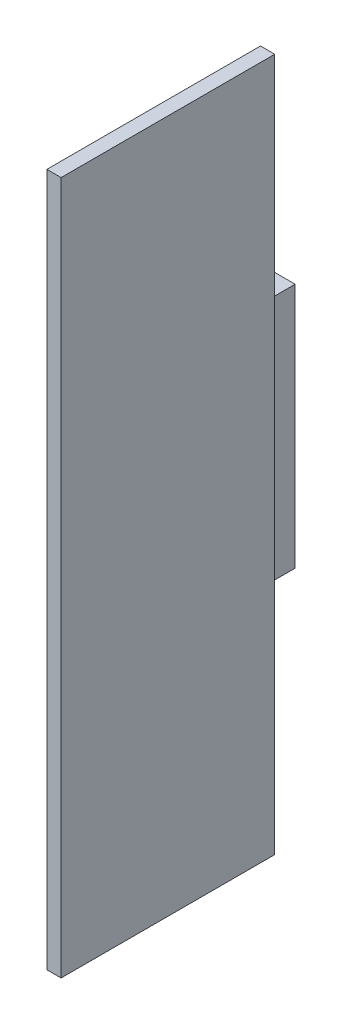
ISO-10303-21;
HEADER;
FILE_DESCRIPTION(('STEP AP214'),'2;1');
FILE_NAME('part.step','',(''),(''),'','','');
FILE_SCHEMA(('AUTOMOTIVE_DESIGN { 1 0 10303 214 1 1 1 1 }'));
ENDSEC;
DATA;
#1=APPLICATION_CONTEXT('core data for automotive mechanical design processes');
#2=APPLICATION_PROTOCOL_DEFINITION('international standard','automotive_design',2000,#1);
#3=PRODUCT_CONTEXT('',#1,'mechanical');
#4=PRODUCT('Part','Part','',(#3));
#5=PRODUCT_RELATED_PRODUCT_CATEGORY('part','',(#4));
#6=PRODUCT_DEFINITION_FORMATION('','',#4);
#7=PRODUCT_DEFINITION_CONTEXT('part definition',#1,'design');
#8=PRODUCT_DEFINITION('design','',#6,#7);
#9=PRODUCT_DEFINITION_SHAPE('','',#8);
#10=(LENGTH_UNIT() NAMED_UNIT(*) SI_UNIT(.MILLI.,.METRE.));
#11=(NAMED_UNIT(*) PLANE_ANGLE_UNIT() SI_UNIT($,.RADIAN.));
#12=(NAMED_UNIT(*) SI_UNIT($,.STERADIAN.) SOLID_ANGLE_UNIT());
#13=UNCERTAINTY_MEASURE_WITH_UNIT(LENGTH_MEASURE(1.E-05),#10,'distance_accuracy_value','');
#14=(GEOMETRIC_REPRESENTATION_CONTEXT(3) GLOBAL_UNCERTAINTY_ASSIGNED_CONTEXT((#13)) GLOBAL_UNIT_ASSIGNED_CONTEXT((#10,
#11,#12)) REPRESENTATION_CONTEXT('',''));
#15=CARTESIAN_POINT('',(0.,0.,0.));
#16=DIRECTION('',(0.,0.,1.));
#17=DIRECTION('',(1.,0.,0.));
#18=AXIS2_PLACEMENT_3D('',#15,#16,#17);
#19=CARTESIAN_POINT('',(3.,73.,45.));
#20=DIRECTION('',(0.,0.,-1.));
#21=DIRECTION('',(0.,1.,0.));
#22=AXIS2_PLACEMENT_3D('',#19,#20,#21);
#23=PLANE('',#22);
#24=DIRECTION('',(0.,-1.,0.));
#25=VECTOR('',#24,1.);
#26=CARTESIAN_POINT('',(0.,73.,45.));
#27=LINE('',#26,#25);
#28=CARTESIAN_POINT('',(0.,73.,45.));
#29=VERTEX_POINT('',#28);
#30=CARTESIAN_POINT('',(0.,-73.,45.));
#31=VERTEX_POINT('',#30);
#32=EDGE_CURVE('E155',#29,#31,#27,.T.);
#33=ORIENTED_EDGE('',*,*,#32,.T.);
#34=DIRECTION('',(-1.,0.,0.));
#35=VECTOR('',#34,1.);
#36=CARTESIAN_POINT('',(3.,-73.,45.));
#37=LINE('',#36,#35);
#38=CARTESIAN_POINT('',(3.,-73.,45.));
#39=VERTEX_POINT('',#38);
#40=EDGE_CURVE('E9',#39,#31,#37,.T.);
#41=ORIENTED_EDGE('',*,*,#40,.F.);
#42=DIRECTION('',(0.,-1.,0.));
#43=VECTOR('',#42,1.);
#44=CARTESIAN_POINT('',(3.,73.,45.));
#45=LINE('',#44,#43);
#46=CARTESIAN_POINT('',(3.,73.,45.));
#47=VERTEX_POINT('',#46);
#48=EDGE_CURVE('E196',#47,#39,#45,.T.);
#49=ORIENTED_EDGE('',*,*,#48,.F.);
#50=DIRECTION('',(-1.,0.,0.));
#51=VECTOR('',#50,1.);
#52=CARTESIAN_POINT('',(3.,73.,45.));
#53=LINE('',#52,#51);
#54=EDGE_CURVE('E193',#47,#29,#53,.T.);
#55=ORIENTED_EDGE('',*,*,#54,.T.);
#56=EDGE_LOOP('',(#33,#41,#49,#55));
#57=FACE_BOUND('',#56,.T.);
#58=ADVANCED_FACE('F14',(#57),#23,.F.);
#59=CARTESIAN_POINT('',(3.,-73.,45.));
#60=DIRECTION('',(0.,1.,0.));
#61=DIRECTION('',(-1.,0.,0.));
#62=AXIS2_PLACEMENT_3D('',#59,#60,#61);
#63=PLANE('',#62);
#64=DIRECTION('',(0.,0.,-1.));
#65=VECTOR('',#64,1.);
#66=CARTESIAN_POINT('',(0.,-73.,45.));
#67=LINE('',#66,#65);
#68=CARTESIAN_POINT('',(0.,-73.,0.));
#69=VERTEX_POINT('',#68);
#70=EDGE_CURVE('E165',#31,#69,#67,.T.);
#71=ORIENTED_EDGE('',*,*,#70,.T.);
#72=DIRECTION('',(-1.,0.,0.));
#73=VECTOR('',#72,1.);
#74=CARTESIAN_POINT('',(3.,-73.,0.));
#75=LINE('',#74,#73);
#76=CARTESIAN_POINT('',(3.,-73.,0.));
#77=VERTEX_POINT('',#76);
#78=EDGE_CURVE('E23',#77,#69,#75,.T.);
#79=ORIENTED_EDGE('',*,*,#78,.F.);
#80=DIRECTION('',(0.,0.,-1.));
#81=VECTOR('',#80,1.);
#82=CARTESIAN_POINT('',(3.,-73.,45.));
#83=LINE('',#82,#81);
#84=EDGE_CURVE('E197',#39,#77,#83,.T.);
#85=ORIENTED_EDGE('',*,*,#84,.F.);
#86=ORIENTED_EDGE('',*,*,#40,.T.);
#87=EDGE_LOOP('',(#71,#79,#85,#86));
#88=FACE_BOUND('',#87,.T.);
#89=ADVANCED_FACE('F208',(#88),#63,.F.);
#90=CARTESIAN_POINT('',(3.,-73.,0.));
#91=DIRECTION('',(0.,0.,1.));
#92=DIRECTION('',(1.,0.,0.));
#93=AXIS2_PLACEMENT_3D('',#90,#91,#92);
#94=PLANE('',#93);
#95=DIRECTION('',(0.,1.,0.));
#96=VECTOR('',#95,1.);
#97=CARTESIAN_POINT('',(0.,-73.,0.));
#98=LINE('',#97,#96);
#99=CARTESIAN_POINT('',(0.,-35.,0.));
#100=VERTEX_POINT('',#99);
#101=EDGE_CURVE('E178',#69,#100,#98,.T.);
#102=ORIENTED_EDGE('',*,*,#101,.T.);
#103=DIRECTION('',(1.,0.,0.));
#104=VECTOR('',#103,1.);
#105=CARTESIAN_POINT('',(-6.,-35.,0.));
#106=LINE('',#105,#104);
#107=CARTESIAN_POINT('',(-6.,-35.,0.));
#108=VERTEX_POINT('',#107);
#109=EDGE_CURVE('E112',#108,#100,#106,.T.);
#110=ORIENTED_EDGE('',*,*,#109,.F.);
#111=DIRECTION('',(0.,1.,0.));
#112=VECTOR('',#111,1.);
#113=CARTESIAN_POINT('',(-6.,-35.,0.));
#114=LINE('',#113,#112);
#115=CARTESIAN_POINT('',(-6.,-25.9,0.));
#116=VERTEX_POINT('',#115);
#117=EDGE_CURVE('E136',#108,#116,#114,.T.);
#118=ORIENTED_EDGE('',*,*,#117,.T.);
#119=DIRECTION('',(1.,0.,0.));
#120=VECTOR('',#119,1.);
#121=CARTESIAN_POINT('',(-6.,-25.9,0.));
#122=LINE('',#121,#120);
#123=CARTESIAN_POINT('',(0.,-25.9,0.));
#124=VERTEX_POINT('',#123);
#125=EDGE_CURVE('E161',#116,#124,#122,.T.);
#126=ORIENTED_EDGE('',*,*,#125,.T.);
#127=CARTESIAN_POINT('',(0.,25.9,0.));
#128=VERTEX_POINT('',#127);
#129=EDGE_CURVE('E179',#124,#128,#98,.T.);
#130=ORIENTED_EDGE('',*,*,#129,.T.);
#131=DIRECTION('',(1.,0.,0.));
#132=VECTOR('',#131,1.);
#133=CARTESIAN_POINT('',(-6.,25.9,0.));
#134=LINE('',#133,#132);
#135=CARTESIAN_POINT('',(-6.,25.9,0.));
#136=VERTEX_POINT('',#135);
#137=EDGE_CURVE('E159',#136,#128,#134,.T.);
#138=ORIENTED_EDGE('',*,*,#137,.F.);
#139=DIRECTION('',(0.,1.,0.));
#140=VECTOR('',#139,1.);
#141=CARTESIAN_POINT('',(-6.,25.9,0.));
#142=LINE('',#141,#140);
#143=CARTESIAN_POINT('',(-6.,34.9999999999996,0.));
#144=VERTEX_POINT('',#143);
#145=EDGE_CURVE('E148',#136,#144,#142,.T.);
#146=ORIENTED_EDGE('',*,*,#145,.T.);
#147=DIRECTION('',(1.,0.,0.));
#148=VECTOR('',#147,1.);
#149=CARTESIAN_POINT('',(-6.,34.9999999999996,0.));
#150=LINE('',#149,#148);
#151=CARTESIAN_POINT('',(0.,34.9999999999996,0.));
#152=VERTEX_POINT('',#151);
#153=EDGE_CURVE('E156',#144,#152,#150,.T.);
#154=ORIENTED_EDGE('',*,*,#153,.T.);
#155=CARTESIAN_POINT('',(0.,73.,0.));
#156=VERTEX_POINT('',#155);
#157=EDGE_CURVE('E167',#152,#156,#98,.T.);
#158=ORIENTED_EDGE('',*,*,#157,.T.);
#159=DIRECTION('',(-1.,0.,0.));
#160=VECTOR('',#159,1.);
#161=CARTESIAN_POINT('',(3.,73.,0.));
#162=LINE('',#161,#160);
#163=CARTESIAN_POINT('',(3.,73.,0.));
#164=VERTEX_POINT('',#163);
#165=EDGE_CURVE('E188',#164,#156,#162,.T.);
#166=ORIENTED_EDGE('',*,*,#165,.F.);
#167=DIRECTION('',(0.,1.,0.));
#168=VECTOR('',#167,1.);
#169=CARTESIAN_POINT('',(3.,-73.,0.));
#170=LINE('',#169,#168);
#171=EDGE_CURVE('E200',#77,#164,#170,.T.);
#172=ORIENTED_EDGE('',*,*,#171,.F.);
#173=ORIENTED_EDGE('',*,*,#78,.T.);
#174=EDGE_LOOP('',(#102,#110,#118,#126,#130,#138,#146,#154,#158,#166,#172,#173));
#175=FACE_BOUND('',#174,.T.);
#176=ADVANCED_FACE('F186',(#175),#94,.F.);
#177=CARTESIAN_POINT('',(3.,73.,0.));
#178=DIRECTION('',(0.,-1.,0.));
#179=DIRECTION('',(1.,0.,0.));
#180=AXIS2_PLACEMENT_3D('',#177,#178,#179);
#181=PLANE('',#180);
#182=DIRECTION('',(0.,0.,1.));
#183=VECTOR('',#182,1.);
#184=CARTESIAN_POINT('',(0.,73.,0.));
#185=LINE('',#184,#183);
#186=EDGE_CURVE('E170',#156,#29,#185,.T.);
#187=ORIENTED_EDGE('',*,*,#186,.T.);
#188=ORIENTED_EDGE('',*,*,#54,.F.);
#189=DIRECTION('',(0.,0.,1.));
#190=VECTOR('',#189,1.);
#191=CARTESIAN_POINT('',(3.,73.,0.));
#192=LINE('',#191,#190);
#193=EDGE_CURVE('E39',#164,#47,#192,.T.);
#194=ORIENTED_EDGE('',*,*,#193,.F.);
#195=ORIENTED_EDGE('',*,*,#165,.T.);
#196=EDGE_LOOP('',(#187,#188,#194,#195));
#197=FACE_BOUND('',#196,.T.);
#198=ADVANCED_FACE('F191',(#197),#181,.F.);
#199=CARTESIAN_POINT('',(3.,-73.,45.));
#200=DIRECTION('',(1.,0.,0.));
#201=DIRECTION('',(0.,1.,0.));
#202=AXIS2_PLACEMENT_3D('',#199,#200,#201);
#203=PLANE('',#202);
#204=ORIENTED_EDGE('',*,*,#48,.T.);
#205=ORIENTED_EDGE('',*,*,#84,.T.);
#206=ORIENTED_EDGE('',*,*,#171,.T.);
#207=ORIENTED_EDGE('',*,*,#193,.T.);
#208=EDGE_LOOP('',(#204,#205,#206,#207));
#209=FACE_BOUND('',#208,.T.);
#210=ADVANCED_FACE('F224',(#209),#203,.T.);
#211=CARTESIAN_POINT('',(0.,-73.,45.));
#212=DIRECTION('',(1.,0.,0.));
#213=DIRECTION('',(0.,1.,0.));
#214=AXIS2_PLACEMENT_3D('',#211,#212,#213);
#215=PLANE('',#214);
#216=DIRECTION('',(0.,-1.,0.));
#217=VECTOR('',#216,1.);
#218=CARTESIAN_POINT('',(0.,-35.,7.69999999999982));
#219=LINE('',#218,#217);
#220=CARTESIAN_POINT('',(0.,35.,7.69999999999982));
#221=VERTEX_POINT('',#220);
#222=CARTESIAN_POINT('',(0.,-35.,7.69999999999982));
#223=VERTEX_POINT('',#222);
#224=EDGE_CURVE('E31',#221,#223,#219,.T.);
#225=ORIENTED_EDGE('',*,*,#224,.T.);
#226=DIRECTION('',(0.,0.,-1.));
#227=VECTOR('',#226,1.);
#228=CARTESIAN_POINT('',(0.,-35.,0.));
#229=LINE('',#228,#227);
#230=EDGE_CURVE('E17',#223,#100,#229,.T.);
#231=ORIENTED_EDGE('',*,*,#230,.T.);
#232=ORIENTED_EDGE('',*,*,#101,.F.);
#233=ORIENTED_EDGE('',*,*,#70,.F.);
#234=ORIENTED_EDGE('',*,*,#32,.F.);
#235=ORIENTED_EDGE('',*,*,#186,.F.);
#236=ORIENTED_EDGE('',*,*,#157,.F.);
#237=DIRECTION('',(0.,0.,1.));
#238=VECTOR('',#237,1.);
#239=CARTESIAN_POINT('',(0.,35.,7.69999999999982));
#240=LINE('',#239,#238);
#241=EDGE_CURVE('E125',#152,#221,#240,.T.);
#242=ORIENTED_EDGE('',*,*,#241,.T.);
#243=EDGE_LOOP('',(#225,#231,#232,#233,#234,#235,#236,#242));
#244=FACE_BOUND('',#243,.T.);
#245=ADVANCED_FACE('F122',(#244),#215,.F.);
#246=CARTESIAN_POINT('',(0.,25.9,7.69999999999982));
#247=DIRECTION('',(1.,0.,0.));
#248=DIRECTION('',(0.,1.,0.));
#249=AXIS2_PLACEMENT_3D('',#246,#247,#248);
#250=PLANE('',#249);
#251=ORIENTED_EDGE('',*,*,#129,.F.);
#252=DIRECTION('',(0.,0.,-1.));
#253=VECTOR('',#252,1.);
#254=CARTESIAN_POINT('',(0.,-25.9,0.));
#255=LINE('',#254,#253);
#256=CARTESIAN_POINT('',(0.,-25.9,-7.30000000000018));
#257=VERTEX_POINT('',#256);
#258=EDGE_CURVE('E120',#124,#257,#255,.T.);
#259=ORIENTED_EDGE('',*,*,#258,.T.);
#260=DIRECTION('',(0.,1.,0.));
#261=VECTOR('',#260,1.);
#262=CARTESIAN_POINT('',(0.,-25.9,-7.30000000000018));
#263=LINE('',#262,#261);
#264=CARTESIAN_POINT('',(0.,25.9,-7.30000000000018));
#265=VERTEX_POINT('',#264);
#266=EDGE_CURVE('E129',#257,#265,#263,.T.);
#267=ORIENTED_EDGE('',*,*,#266,.T.);
#268=DIRECTION('',(0.,0.,1.));
#269=VECTOR('',#268,1.);
#270=CARTESIAN_POINT('',(0.,25.9,-7.30000000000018));
#271=LINE('',#270,#269);
#272=EDGE_CURVE('E132',#265,#128,#271,.T.);
#273=ORIENTED_EDGE('',*,*,#272,.T.);
#274=EDGE_LOOP('',(#251,#259,#267,#273));
#275=FACE_BOUND('',#274,.T.);
#276=ADVANCED_FACE('F229',(#275),#250,.T.);
#277=CARTESIAN_POINT('',(-6.,-35.,7.69999999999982));
#278=DIRECTION('',(0.,0.,1.));
#279=DIRECTION('',(1.,0.,0.));
#280=AXIS2_PLACEMENT_3D('',#277,#278,#279);
#281=PLANE('',#280);
#282=ORIENTED_EDGE('',*,*,#224,.F.);
#283=DIRECTION('',(1.,0.,0.));
#284=VECTOR('',#283,1.);
#285=CARTESIAN_POINT('',(-6.,35.,7.69999999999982));
#286=LINE('',#285,#284);
#287=CARTESIAN_POINT('',(-6.,35.,7.69999999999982));
#288=VERTEX_POINT('',#287);
#289=EDGE_CURVE('E153',#288,#221,#286,.T.);
#290=ORIENTED_EDGE('',*,*,#289,.F.);
#291=DIRECTION('',(0.,-1.,0.));
#292=VECTOR('',#291,1.);
#293=CARTESIAN_POINT('',(-6.,-35.,7.69999999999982));
#294=LINE('',#293,#292);
#295=CARTESIAN_POINT('',(-6.,-35.,7.69999999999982));
#296=VERTEX_POINT('',#295);
#297=EDGE_CURVE('E108',#288,#296,#294,.T.);
#298=ORIENTED_EDGE('',*,*,#297,.T.);
#299=DIRECTION('',(1.,0.,0.));
#300=VECTOR('',#299,1.);
#301=CARTESIAN_POINT('',(-6.,-35.,7.69999999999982));
#302=LINE('',#301,#300);
#303=EDGE_CURVE('E104',#296,#223,#302,.T.);
#304=ORIENTED_EDGE('',*,*,#303,.T.);
#305=EDGE_LOOP('',(#282,#290,#298,#304));
#306=FACE_BOUND('',#305,.T.);
#307=ADVANCED_FACE('F106',(#306),#281,.T.);
#308=CARTESIAN_POINT('',(-6.,35.,7.69999999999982));
#309=DIRECTION('',(0.,1.,0.));
#310=DIRECTION('',(0.,0.,1.));
#311=AXIS2_PLACEMENT_3D('',#308,#309,#310);
#312=PLANE('',#311);
#313=ORIENTED_EDGE('',*,*,#241,.F.);
#314=ORIENTED_EDGE('',*,*,#153,.F.);
#315=DIRECTION('',(0.,0.,1.));
#316=VECTOR('',#315,1.);
#317=CARTESIAN_POINT('',(-6.,35.,7.69999999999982));
#318=LINE('',#317,#316);
#319=EDGE_CURVE('E113',#144,#288,#318,.T.);
#320=ORIENTED_EDGE('',*,*,#319,.T.);
#321=ORIENTED_EDGE('',*,*,#289,.T.);
#322=EDGE_LOOP('',(#313,#314,#320,#321));
#323=FACE_BOUND('',#322,.T.);
#324=ADVANCED_FACE('F232',(#323),#312,.T.);
#325=CARTESIAN_POINT('',(-6.,25.9,-7.30000000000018));
#326=DIRECTION('',(0.,1.,0.));
#327=DIRECTION('',(-1.,0.,0.));
#328=AXIS2_PLACEMENT_3D('',#325,#326,#327);
#329=PLANE('',#328);
#330=ORIENTED_EDGE('',*,*,#272,.F.);
#331=DIRECTION('',(1.,0.,0.));
#332=VECTOR('',#331,1.);
#333=CARTESIAN_POINT('',(-6.,25.9,-7.30000000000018));
#334=LINE('',#333,#332);
#335=CARTESIAN_POINT('',(-6.,25.9,-7.30000000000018));
#336=VERTEX_POINT('',#335);
#337=EDGE_CURVE('E157',#336,#265,#334,.T.);
#338=ORIENTED_EDGE('',*,*,#337,.F.);
#339=DIRECTION('',(0.,0.,1.));
#340=VECTOR('',#339,1.);
#341=CARTESIAN_POINT('',(-6.,25.9,-7.30000000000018));
#342=LINE('',#341,#340);
#343=EDGE_CURVE('E145',#336,#136,#342,.T.);
#344=ORIENTED_EDGE('',*,*,#343,.T.);
#345=ORIENTED_EDGE('',*,*,#137,.T.);
#346=EDGE_LOOP('',(#330,#338,#344,#345));
#347=FACE_BOUND('',#346,.T.);
#348=ADVANCED_FACE('F243',(#347),#329,.T.);
#349=CARTESIAN_POINT('',(-6.,-25.9,-7.30000000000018));
#350=DIRECTION('',(0.,0.,-1.));
#351=DIRECTION('',(-1.,0.,0.));
#352=AXIS2_PLACEMENT_3D('',#349,#350,#351);
#353=PLANE('',#352);
#354=ORIENTED_EDGE('',*,*,#266,.F.);
#355=DIRECTION('',(1.,0.,0.));
#356=VECTOR('',#355,1.);
#357=CARTESIAN_POINT('',(-6.,-25.9,-7.30000000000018));
#358=LINE('',#357,#356);
#359=CARTESIAN_POINT('',(-6.,-25.9,-7.30000000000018));
#360=VERTEX_POINT('',#359);
#361=EDGE_CURVE('E160',#360,#257,#358,.T.);
#362=ORIENTED_EDGE('',*,*,#361,.F.);
#363=DIRECTION('',(0.,1.,0.));
#364=VECTOR('',#363,1.);
#365=CARTESIAN_POINT('',(-6.,-25.9,-7.30000000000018));
#366=LINE('',#365,#364);
#367=EDGE_CURVE('E142',#360,#336,#366,.T.);
#368=ORIENTED_EDGE('',*,*,#367,.T.);
#369=ORIENTED_EDGE('',*,*,#337,.T.);
#370=EDGE_LOOP('',(#354,#362,#368,#369));
#371=FACE_BOUND('',#370,.T.);
#372=ADVANCED_FACE('F239',(#371),#353,.T.);
#373=CARTESIAN_POINT('',(-6.,-25.9,0.));
#374=DIRECTION('',(0.,-1.,0.));
#375=DIRECTION('',(1.,0.,0.));
#376=AXIS2_PLACEMENT_3D('',#373,#374,#375);
#377=PLANE('',#376);
#378=ORIENTED_EDGE('',*,*,#258,.F.);
#379=ORIENTED_EDGE('',*,*,#125,.F.);
#380=DIRECTION('',(0.,0.,-1.));
#381=VECTOR('',#380,1.);
#382=CARTESIAN_POINT('',(-6.,-25.9,0.));
#383=LINE('',#382,#381);
#384=EDGE_CURVE('E139',#116,#360,#383,.T.);
#385=ORIENTED_EDGE('',*,*,#384,.T.);
#386=ORIENTED_EDGE('',*,*,#361,.T.);
#387=EDGE_LOOP('',(#378,#379,#385,#386));
#388=FACE_BOUND('',#387,.T.);
#389=ADVANCED_FACE('F236',(#388),#377,.T.);
#390=CARTESIAN_POINT('',(-6.,-35.,0.));
#391=DIRECTION('',(0.,-1.,0.));
#392=DIRECTION('',(1.,0.,0.));
#393=AXIS2_PLACEMENT_3D('',#390,#391,#392);
#394=PLANE('',#393);
#395=ORIENTED_EDGE('',*,*,#230,.F.);
#396=ORIENTED_EDGE('',*,*,#303,.F.);
#397=DIRECTION('',(0.,0.,-1.));
#398=VECTOR('',#397,1.);
#399=CARTESIAN_POINT('',(-6.,-35.,0.));
#400=LINE('',#399,#398);
#401=EDGE_CURVE('E134',#296,#108,#400,.T.);
#402=ORIENTED_EDGE('',*,*,#401,.T.);
#403=ORIENTED_EDGE('',*,*,#109,.T.);
#404=EDGE_LOOP('',(#395,#396,#402,#403));
#405=FACE_BOUND('',#404,.T.);
#406=ADVANCED_FACE('F116',(#405),#394,.T.);
#407=CARTESIAN_POINT('',(-6.,25.9,7.69999999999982));
#408=DIRECTION('',(1.,0.,0.));
#409=DIRECTION('',(0.,1.,0.));
#410=AXIS2_PLACEMENT_3D('',#407,#408,#409);
#411=PLANE('',#410);
#412=ORIENTED_EDGE('',*,*,#297,.F.);
#413=ORIENTED_EDGE('',*,*,#319,.F.);
#414=ORIENTED_EDGE('',*,*,#145,.F.);
#415=ORIENTED_EDGE('',*,*,#343,.F.);
#416=ORIENTED_EDGE('',*,*,#367,.F.);
#417=ORIENTED_EDGE('',*,*,#384,.F.);
#418=ORIENTED_EDGE('',*,*,#117,.F.);
#419=ORIENTED_EDGE('',*,*,#401,.F.);
#420=EDGE_LOOP('',(#412,#413,#414,#415,#416,#417,#418,#419));
#421=FACE_BOUND('',#420,.T.);
#422=ADVANCED_FACE('F235',(#421),#411,.F.);
#423=CLOSED_SHELL('',(#58,#89,#176,#198,#210,#245,#276,#307,#324,#348,#372,#389,#406,#422));
#424=MANIFOLD_SOLID_BREP('B1',#423);
#425=ADVANCED_BREP_SHAPE_REPRESENTATION('',(#18,#424),#14);
#426=SHAPE_DEFINITION_REPRESENTATION(#9,#425);
ENDSEC;
END-ISO-10303-21;
